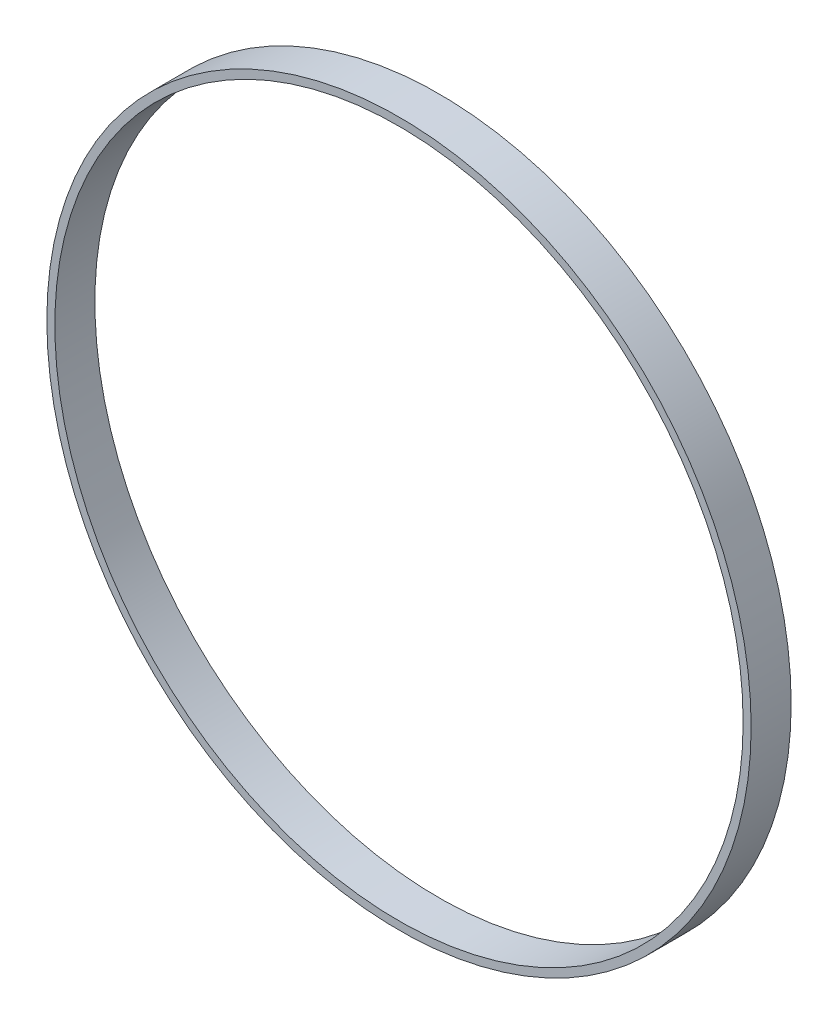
from build123d import *

# Parameters (mm, degrees)
ESQUISSE1_R      = 44
ESQUISSE1_R_2    = 43
EXTRUSION1_DEPTH = 5


with BuildPart() as part:
    # Esquisse1 → Extrusion1 (new body)
    with BuildSketch(Plane.XY):
        Circle(ESQUISSE1_R)
        Circle(ESQUISSE1_R_2, mode=Mode.SUBTRACT)
    extrude(amount=EXTRUSION1_DEPTH)


solid = part.part
